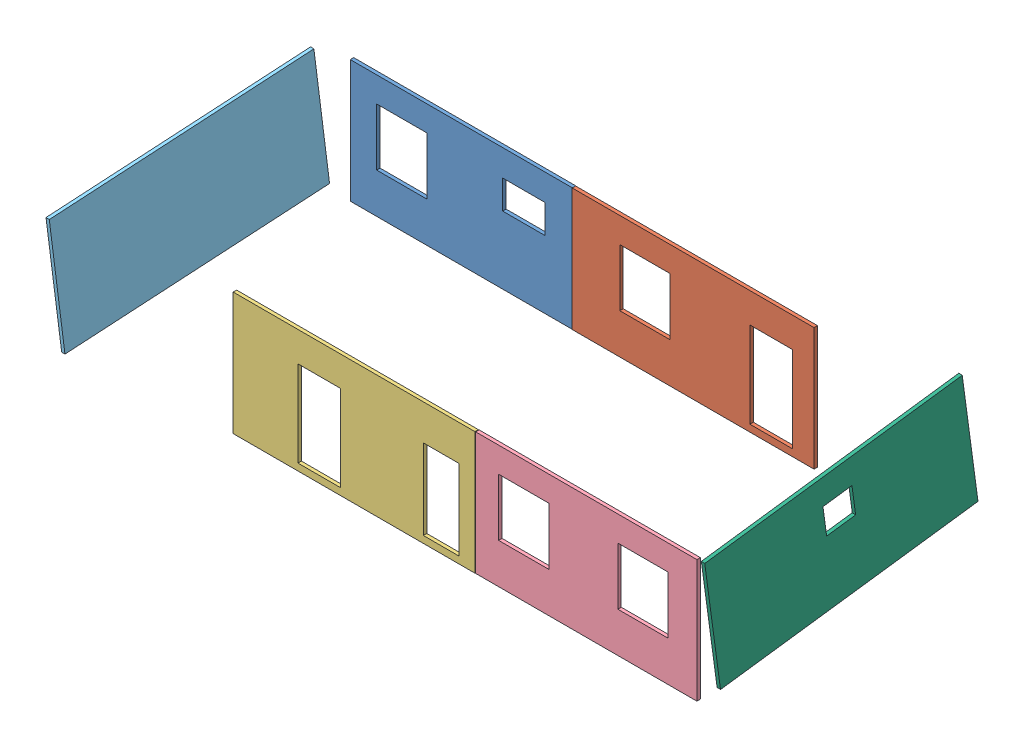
SolidWorks assembly Assemblage_av-ar.SLDASM, configuration Défaut (file format 3400). Lengths in mm.
Overall size (492.98 294.28 332.09).
8 component instances, 6 part files, 0 mates.
Components (placement in the parent):
- Assemblage_ar-1: Assemblage_ar.SLDASM [Défaut] at (202.1038 324.8712 -133.6964) size (405.44 107.56 3.75)
  - doublage_AR-G-1: doublage_AR-G.SLDPRT [Défaut] at (-175.6761 -67.5433 -1.5) size (194 107 3)
  - doublage_AR-D-1: doublage_AR-D.SLDPRT [Défaut] at (18.7626 -66.9799 -0.75) size (211 107 3)
- Assemblage_av-1: Assemblage_av.SLDASM [Défaut] at (154.6144 155.575 -95.168) size (404.62 107.13 3)
  - doublage_AV-G-1: doublage_AV-G.SLDPRT [Défaut] at (-190.3343 -84.9678 0) size (211 107 3)
  - doublage_AV-D-1: doublage_AV-D.SLDPRT [Défaut] at (21.2894 -84.8365 0) size (193 107 3)
- doublage_G-1: doublage_G.SLDPRT [Défaut] at (-24.5537 323.811 79.4895) x (0.0471 0.108001 -0.993034) z (-0.998675 -0.015546 -0.049059) size (222 107 3)
- doublage_D-1: doublage_D.SLDPRT [Défaut] at (453.8415 184.0046 -252.5419) x (-0.025327 -0.159799 0.986825) z (-0.999169 0.035594 -0.01988) size (222 107 3)
